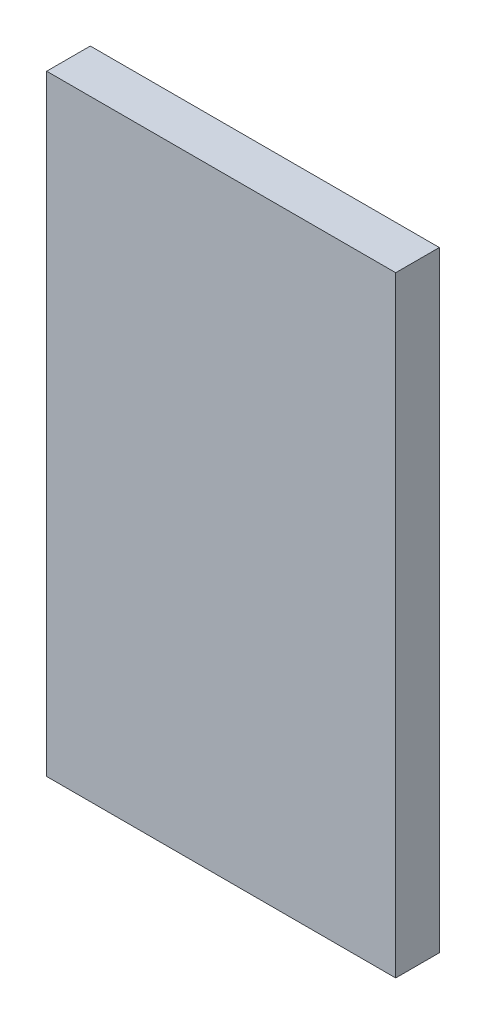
ISO-10303-21;
HEADER;
FILE_DESCRIPTION(('STEP AP214'),'2;1');
FILE_NAME('part.step','',(''),(''),'','','');
FILE_SCHEMA(('AUTOMOTIVE_DESIGN { 1 0 10303 214 1 1 1 1 }'));
ENDSEC;
DATA;
#1=APPLICATION_CONTEXT('core data for automotive mechanical design processes');
#2=APPLICATION_PROTOCOL_DEFINITION('international standard','automotive_design',2000,#1);
#3=PRODUCT_CONTEXT('',#1,'mechanical');
#4=PRODUCT('Part','Part','',(#3));
#5=PRODUCT_RELATED_PRODUCT_CATEGORY('part','',(#4));
#6=PRODUCT_DEFINITION_FORMATION('','',#4);
#7=PRODUCT_DEFINITION_CONTEXT('part definition',#1,'design');
#8=PRODUCT_DEFINITION('design','',#6,#7);
#9=PRODUCT_DEFINITION_SHAPE('','',#8);
#10=(LENGTH_UNIT() NAMED_UNIT(*) SI_UNIT(.MILLI.,.METRE.));
#11=(NAMED_UNIT(*) PLANE_ANGLE_UNIT() SI_UNIT($,.RADIAN.));
#12=(NAMED_UNIT(*) SI_UNIT($,.STERADIAN.) SOLID_ANGLE_UNIT());
#13=UNCERTAINTY_MEASURE_WITH_UNIT(LENGTH_MEASURE(1.E-05),#10,'distance_accuracy_value','');
#14=(GEOMETRIC_REPRESENTATION_CONTEXT(3) GLOBAL_UNCERTAINTY_ASSIGNED_CONTEXT((#13)) GLOBAL_UNIT_ASSIGNED_CONTEXT((#10,
#11,#12)) REPRESENTATION_CONTEXT('',''));
#15=CARTESIAN_POINT('',(0.,0.,0.));
#16=DIRECTION('',(0.,0.,1.));
#17=DIRECTION('',(1.,0.,0.));
#18=AXIS2_PLACEMENT_3D('',#15,#16,#17);
#19=CARTESIAN_POINT('',(0.,0.,5.));
#20=DIRECTION('',(1.,0.,0.));
#21=DIRECTION('',(0.,0.,-1.));
#22=AXIS2_PLACEMENT_3D('',#19,#20,#21);
#23=PLANE('',#22);
#24=DIRECTION('',(0.,-1.,0.));
#25=VECTOR('',#24,1.);
#26=CARTESIAN_POINT('',(0.,0.,0.));
#27=LINE('',#26,#25);
#28=CARTESIAN_POINT('',(0.,70.,0.));
#29=VERTEX_POINT('',#28);
#30=CARTESIAN_POINT('',(0.,0.,0.));
#31=VERTEX_POINT('',#30);
#32=EDGE_CURVE('E68',#29,#31,#27,.T.);
#33=ORIENTED_EDGE('',*,*,#32,.T.);
#34=DIRECTION('',(0.,0.,-1.));
#35=VECTOR('',#34,1.);
#36=CARTESIAN_POINT('',(0.,0.,5.));
#37=LINE('',#36,#35);
#38=CARTESIAN_POINT('',(0.,0.,5.));
#39=VERTEX_POINT('',#38);
#40=EDGE_CURVE('E11',#39,#31,#37,.T.);
#41=ORIENTED_EDGE('',*,*,#40,.F.);
#42=DIRECTION('',(0.,-1.,0.));
#43=VECTOR('',#42,1.);
#44=CARTESIAN_POINT('',(0.,0.,5.));
#45=LINE('',#44,#43);
#46=CARTESIAN_POINT('',(0.,70.,5.));
#47=VERTEX_POINT('',#46);
#48=EDGE_CURVE('E86',#47,#39,#45,.T.);
#49=ORIENTED_EDGE('',*,*,#48,.F.);
#50=DIRECTION('',(0.,0.,-1.));
#51=VECTOR('',#50,1.);
#52=CARTESIAN_POINT('',(0.,70.,5.));
#53=LINE('',#52,#51);
#54=EDGE_CURVE('E80',#47,#29,#53,.T.);
#55=ORIENTED_EDGE('',*,*,#54,.T.);
#56=EDGE_LOOP('',(#33,#41,#49,#55));
#57=FACE_BOUND('',#56,.T.);
#58=ADVANCED_FACE('F24',(#57),#23,.F.);
#59=CARTESIAN_POINT('',(0.,0.,5.));
#60=DIRECTION('',(0.,1.,0.));
#61=DIRECTION('',(0.,0.,1.));
#62=AXIS2_PLACEMENT_3D('',#59,#60,#61);
#63=PLANE('',#62);
#64=DIRECTION('',(1.,0.,0.));
#65=VECTOR('',#64,1.);
#66=CARTESIAN_POINT('',(0.,0.,0.));
#67=LINE('',#66,#65);
#68=CARTESIAN_POINT('',(40.,0.,0.));
#69=VERTEX_POINT('',#68);
#70=EDGE_CURVE('E64',#31,#69,#67,.T.);
#71=ORIENTED_EDGE('',*,*,#70,.T.);
#72=DIRECTION('',(0.,0.,-1.));
#73=VECTOR('',#72,1.);
#74=CARTESIAN_POINT('',(40.,0.,5.));
#75=LINE('',#74,#73);
#76=CARTESIAN_POINT('',(40.,0.,5.));
#77=VERTEX_POINT('',#76);
#78=EDGE_CURVE('E31',#77,#69,#75,.T.);
#79=ORIENTED_EDGE('',*,*,#78,.F.);
#80=DIRECTION('',(1.,0.,0.));
#81=VECTOR('',#80,1.);
#82=CARTESIAN_POINT('',(0.,0.,5.));
#83=LINE('',#82,#81);
#84=EDGE_CURVE('E76',#39,#77,#83,.T.);
#85=ORIENTED_EDGE('',*,*,#84,.F.);
#86=ORIENTED_EDGE('',*,*,#40,.T.);
#87=EDGE_LOOP('',(#71,#79,#85,#86));
#88=FACE_BOUND('',#87,.T.);
#89=ADVANCED_FACE('F75',(#88),#63,.F.);
#90=CARTESIAN_POINT('',(40.,0.,5.));
#91=DIRECTION('',(-1.,0.,0.));
#92=DIRECTION('',(0.,0.,1.));
#93=AXIS2_PLACEMENT_3D('',#90,#91,#92);
#94=PLANE('',#93);
#95=DIRECTION('',(0.,1.,0.));
#96=VECTOR('',#95,1.);
#97=CARTESIAN_POINT('',(40.,0.,0.));
#98=LINE('',#97,#96);
#99=CARTESIAN_POINT('',(40.,70.,0.));
#100=VERTEX_POINT('',#99);
#101=EDGE_CURVE('E69',#69,#100,#98,.T.);
#102=ORIENTED_EDGE('',*,*,#101,.T.);
#103=DIRECTION('',(0.,0.,-1.));
#104=VECTOR('',#103,1.);
#105=CARTESIAN_POINT('',(40.,70.,5.));
#106=LINE('',#105,#104);
#107=CARTESIAN_POINT('',(40.,70.,5.));
#108=VERTEX_POINT('',#107);
#109=EDGE_CURVE('E92',#108,#100,#106,.T.);
#110=ORIENTED_EDGE('',*,*,#109,.F.);
#111=DIRECTION('',(0.,1.,0.));
#112=VECTOR('',#111,1.);
#113=CARTESIAN_POINT('',(40.,0.,5.));
#114=LINE('',#113,#112);
#115=EDGE_CURVE('E43',#77,#108,#114,.T.);
#116=ORIENTED_EDGE('',*,*,#115,.F.);
#117=ORIENTED_EDGE('',*,*,#78,.T.);
#118=EDGE_LOOP('',(#102,#110,#116,#117));
#119=FACE_BOUND('',#118,.T.);
#120=ADVANCED_FACE('F95',(#119),#94,.F.);
#121=CARTESIAN_POINT('',(0.,70.,5.));
#122=DIRECTION('',(0.,-1.,0.));
#123=DIRECTION('',(0.,0.,-1.));
#124=AXIS2_PLACEMENT_3D('',#121,#122,#123);
#125=PLANE('',#124);
#126=DIRECTION('',(-1.,0.,0.));
#127=VECTOR('',#126,1.);
#128=CARTESIAN_POINT('',(0.,70.,0.));
#129=LINE('',#128,#127);
#130=EDGE_CURVE('E84',#100,#29,#129,.T.);
#131=ORIENTED_EDGE('',*,*,#130,.T.);
#132=ORIENTED_EDGE('',*,*,#54,.F.);
#133=DIRECTION('',(-1.,0.,0.));
#134=VECTOR('',#133,1.);
#135=CARTESIAN_POINT('',(0.,70.,5.));
#136=LINE('',#135,#134);
#137=EDGE_CURVE('E38',#108,#47,#136,.T.);
#138=ORIENTED_EDGE('',*,*,#137,.F.);
#139=ORIENTED_EDGE('',*,*,#109,.T.);
#140=EDGE_LOOP('',(#131,#132,#138,#139));
#141=FACE_BOUND('',#140,.T.);
#142=ADVANCED_FACE('F97',(#141),#125,.F.);
#143=CARTESIAN_POINT('',(0.,70.,5.));
#144=DIRECTION('',(0.,0.,-1.));
#145=DIRECTION('',(-1.,0.,0.));
#146=AXIS2_PLACEMENT_3D('',#143,#144,#145);
#147=PLANE('',#146);
#148=ORIENTED_EDGE('',*,*,#48,.T.);
#149=ORIENTED_EDGE('',*,*,#84,.T.);
#150=ORIENTED_EDGE('',*,*,#115,.T.);
#151=ORIENTED_EDGE('',*,*,#137,.T.);
#152=EDGE_LOOP('',(#148,#149,#150,#151));
#153=FACE_BOUND('',#152,.T.);
#154=ADVANCED_FACE('F98',(#153),#147,.F.);
#155=CARTESIAN_POINT('',(0.,70.,0.));
#156=DIRECTION('',(0.,0.,-1.));
#157=DIRECTION('',(-1.,0.,0.));
#158=AXIS2_PLACEMENT_3D('',#155,#156,#157);
#159=PLANE('',#158);
#160=ORIENTED_EDGE('',*,*,#32,.F.);
#161=ORIENTED_EDGE('',*,*,#130,.F.);
#162=ORIENTED_EDGE('',*,*,#101,.F.);
#163=ORIENTED_EDGE('',*,*,#70,.F.);
#164=EDGE_LOOP('',(#160,#161,#162,#163));
#165=FACE_BOUND('',#164,.T.);
#166=ADVANCED_FACE('F65',(#165),#159,.T.);
#167=CLOSED_SHELL('',(#58,#89,#120,#142,#154,#166));
#168=MANIFOLD_SOLID_BREP('B2',#167);
#169=ADVANCED_BREP_SHAPE_REPRESENTATION('',(#18,#168),#14);
#170=SHAPE_DEFINITION_REPRESENTATION(#9,#169);
ENDSEC;
END-ISO-10303-21;
